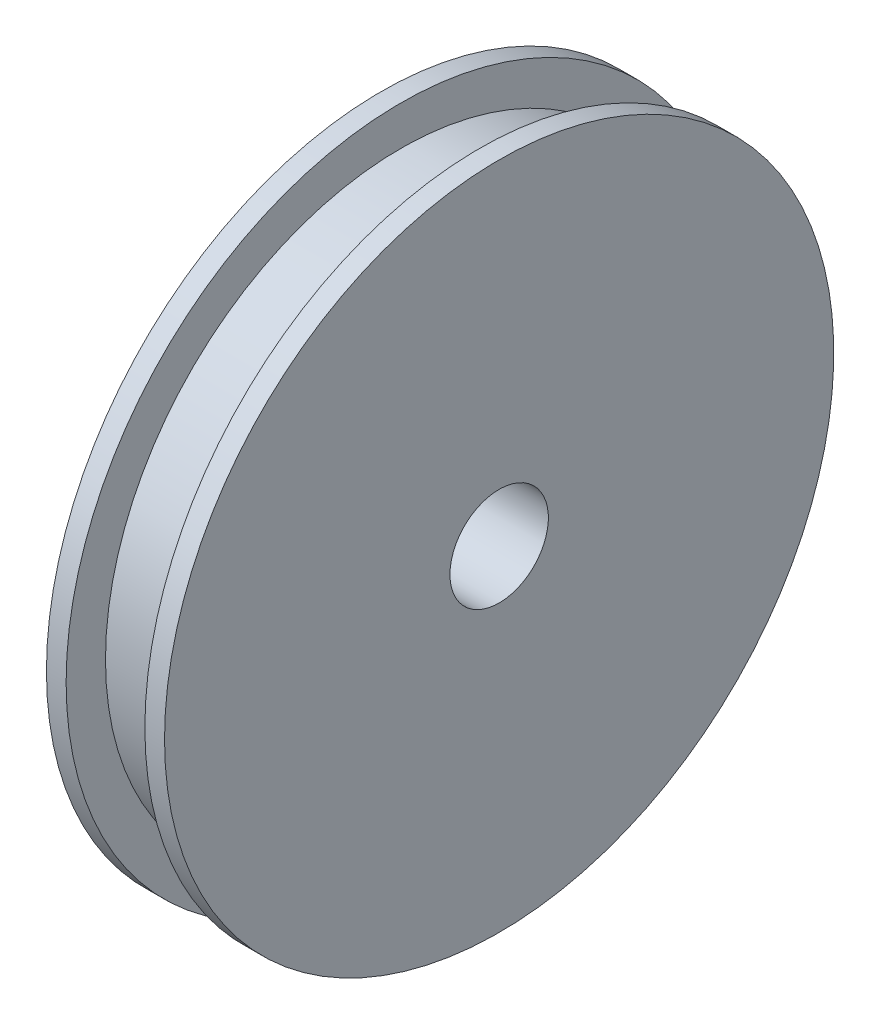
from build123d import *

# Parameters (mm, degrees)
SKETCH_1_R          = 15
EXTRUDE_1_DEPTH     = 3
SKETCH_2_R          = 17
EXTRUDE_2_DEPTH     = 1
SKETCH_3_R          = 3.25
EXTRUDE_3_DEPTH     = 3
SKETCH_4_R          = 2.5
CUT_EXTRUDE_1_DEPTH = 26.670995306
SKETCH_5_R          = 2.5
SKETCH_5_R_2        = 1.75
EXTRUDE_4_DEPTH     = 1


with BuildPart() as part:
    # Sketch 1 → Extrude 1 (new, symmetric)
    with BuildSketch(Plane(origin=(0, 0, 0), x_dir=(0, 0, -1), z_dir=(1, 0, 0))):
        Circle(SKETCH_1_R)
    extrude(amount=EXTRUDE_1_DEPTH, both=True)

    # Sketch 2 → Extrude 2 (add)
    with BuildSketch(Plane.ZY.offset(3)):
        Circle(SKETCH_2_R)
    extrude_2 = extrude(amount=-EXTRUDE_2_DEPTH)

    # Mirror 1: Extrude 2 across plane
    add(extrude_2.mirror(Plane(origin=(0, 0, 0), x_dir=(0, 0, 1), z_dir=(1, 0, 0))))

    # Sketch 3 → Extrude 3 (add)
    with BuildSketch(Plane.ZY.offset(3)):
        with Locations(Location((0, 0, 0), (0, 0, 180))):
            Circle(SKETCH_3_R)
    extrude(amount=EXTRUDE_3_DEPTH)

    # Sketch 4 → Cut-Extrude 1 (cut, through all)
    with BuildSketch(Plane.ZY.offset(6)):
        Circle(SKETCH_4_R)
    extrude(amount=-CUT_EXTRUDE_1_DEPTH, mode=Mode.SUBTRACT)

    # Sketch 5 → Extrude 4 (add)
    with BuildSketch(Plane.ZY.offset(3)):
        Circle(SKETCH_5_R)
        Circle(SKETCH_5_R_2, mode=Mode.SUBTRACT)
    extrude(amount=-EXTRUDE_4_DEPTH)


solid = part.part
